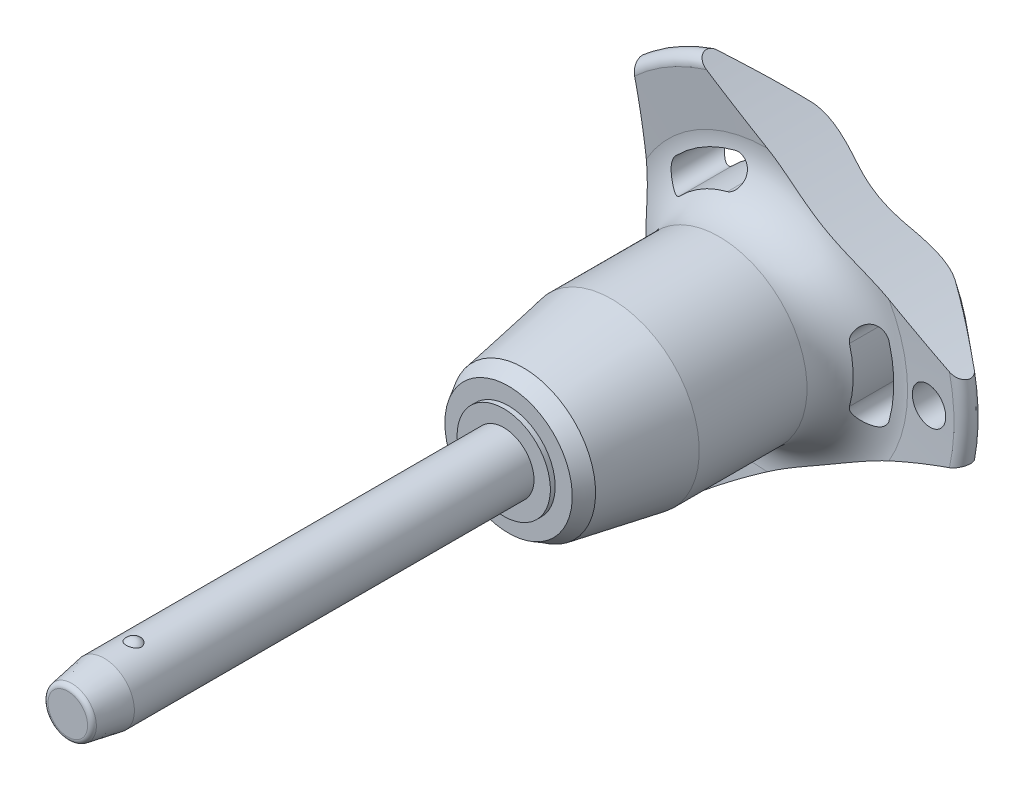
from build123d import *

# Parameters (mm, degrees)
SKETCH1_R           = 2.5
BOSS_EXTRUDE1_DEPTH = 30
SKETCH2_R           = 2.1
BOSS_EXTRUDE2_DEPTH = 26.7
BOSS_EXTRUDE3_START = 6
SKETCH1_2_R         = 2.5
BOSS_EXTRUDE3_DEPTH = 6
CHAMFER1_SIZE       = 3
CHAMFER1_SIZE2      = 0.528980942
FILLET1_R           = 0.4
SKETCH6_R           = 79.96
CUT_EXTRUDE1_DEPTH  = 62.368512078
CIRPATTERN1_COUNT   = 3
SKETCH7_R           = 1.5
CUT_EXTRUDE2_DEPTH  = 62.119983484


with BuildPart() as part:
    # Sketch1 → Boss-Extrude1 (new body)
    with BuildSketch(Plane.XY):
        Circle(SKETCH1_R)
    extrude(amount=-BOSS_EXTRUDE1_DEPTH)

    # Sketch2 → Boss-Extrude2 (add)
    with BuildSketch(Plane(origin=(0, 0, -30), x_dir=(-1, 0, 0), z_dir=(0, 0, -1))):
        Circle(SKETCH2_R)
    extrude(amount=BOSS_EXTRUDE2_DEPTH)

    # Sketch3 → Revolve1 (revolve)
    with BuildSketch(Plane(origin=(0, 0, 0), x_dir=(0, 0, -1), z_dir=(1, 0, 0))):
        with BuildLine():
            Line((-0.580947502, 2.75), (-0.580947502, 1.15))
            ThreePointArc((-0.580947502, 1.15), (0.219052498, 1.95), (-0.580947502, 2.75))
        make_face()
        with BuildLine():
            Line((-0.580947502, -1.15), (-0.580947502, -2.75))
            ThreePointArc((-0.580947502, -2.75), (0.219052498, -1.95), (-0.580947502, -1.15))
        make_face()
    revolve(axis=Axis((0, -1.15, 0.580947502), (0, 1, 0)))

    # Sketch1_2 → Boss-Extrude3 (add)
    with BuildSketch(Plane.XY.offset(BOSS_EXTRUDE3_START)):
        Circle(SKETCH1_2_R)
    extrude(amount=-BOSS_EXTRUDE3_DEPTH)

    # Chamfer1
    chamfer1_edges = [part.edges().sort_by_distance(p)[0] for p in [
        (-2.5, 0, 6),
    ]]
    chamfer1_side = [part.faces().sort_by_distance(p)[0] for p in [
        (-2.5, 0, -12),
    ]]
    chamfer(chamfer1_edges, length=CHAMFER1_SIZE, length2=CHAMFER1_SIZE2, reference=chamfer1_side[0])

    # Fillet1
    fillet1_edges = [part.edges().sort_by_distance(p)[0] for p in [
        (-1.971019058, 0, 6),
        (2.1, 0, -56.7),
    ]]
    fillet(fillet1_edges, radius=FILLET1_R)

    # Sketch4 → Revolve2 (revolve)
    with BuildSketch(Plane(origin=(0, 0, 0), x_dir=(0, 0, -1), z_dir=(1, 0, 0)), mode=Mode.PRIVATE) as revolve2_sk:
        Polygon((30, 0), (30, 3.851837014), (30.4, 3.851837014), (30.4, 5.26161122), (31.620900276, 5.966498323), (38.9, 7.25), (47.8, 7.25), (47.8, 0), align=None)
    revolve(revolve2_sk.sketch.rotate(Axis((0, 0, -47.8), (0, 0, 1)), 90), axis=Axis((0, 0, -47.8), (0, 0, 1)))

    # Sketch5 → Revolve3 (revolve)
    with BuildSketch(Plane(origin=(0, 0, 0), x_dir=(0, 0, -1), z_dir=(1, 0, 0)), mode=Mode.PRIVATE) as revolve3_sk:
        with BuildLine():
            Line((51.78715932, 11.570250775), (51.452568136, 15.735949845))
            ThreePointArc((51.452568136, 15.735949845), (51.946485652, 16.540188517), (52.862835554, 16.314230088))
            Line((52.862835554, 16.314230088), (56.326414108, 12.186497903))
            ThreePointArc((56.326414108, 12.186497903), (56.7, 11.109282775), (56.261488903, 10.056825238))
            ThreePointArc((56.261488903, 10.056825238), (53.289873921, 5.413681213), (52.25, 0))
            Line((52.25, 0), (47.8, 0))
            Line((47.8, 0), (47.8, 7.25))
            ThreePointArc((47.8, 7.25), (50.739473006, 8.537160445), (51.78715932, 11.570250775))
        make_face()
    revolve(revolve3_sk.sketch.rotate(Axis((0, 0, -52.25), (0, 0, 1)), 90), axis=Axis((0, 0, -52.25), (0, 0, 1)))

    # Sketch6 → Cut-Extrude1 (cut, through all)
    with BuildSketch(Plane.XY):
        with Locations((-89.76, 0)):
            Circle(SKETCH6_R)
        with BuildLine():
            ThreePointArc((10.099921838, -2.834717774), (10.490188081, 0), (10.099921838, 2.834717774))
            ThreePointArc((10.099921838, 2.834717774), (8.768180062, 3.582738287), (8.020159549, 2.250996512))
            ThreePointArc((8.020159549, 2.250996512), (8.330062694, 0), (8.020159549, -2.250996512))
            ThreePointArc((8.020159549, -2.250996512), (8.768180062, -3.582738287), (10.099921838, -2.834717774))
        make_face()
    cut_extrude1 = extrude(amount=-CUT_EXTRUDE1_DEPTH, mode=Mode.SUBTRACT)

    # CirPattern1: Cut-Extrude1 ×3 about axis
    cirpattern1_axis = Axis((0, 0, 0), (0, 0, 1))
    for i in range(1, CIRPATTERN1_COUNT):
        add(cut_extrude1.rotate(cirpattern1_axis, i * 360 / CIRPATTERN1_COUNT), mode=Mode.SUBTRACT)

    # Sketch7 → Cut-Extrude2 (cut, through all)
    with BuildSketch(Plane.XY):
        with Locations(Location((13.490188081, 0, 0), (0, 0, 225.221865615))):
            Circle(SKETCH7_R)
    extrude(amount=-CUT_EXTRUDE2_DEPTH, mode=Mode.SUBTRACT)


solid = part.part
